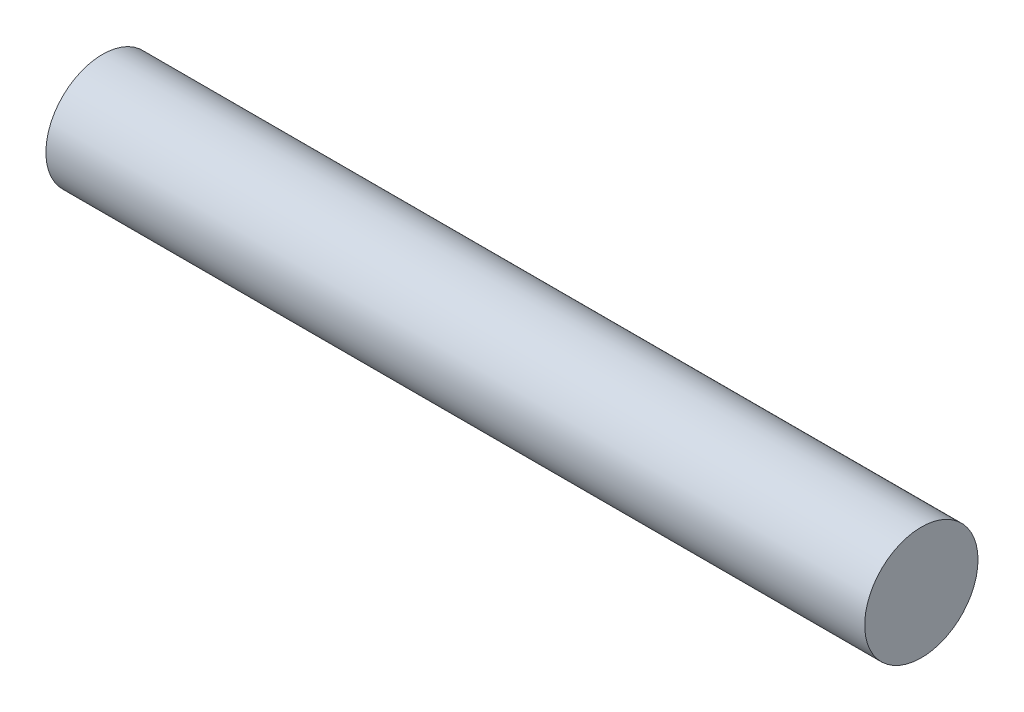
ISO-10303-21;
HEADER;
FILE_DESCRIPTION(('STEP AP214'),'2;1');
FILE_NAME('part.step','',(''),(''),'','','');
FILE_SCHEMA(('AUTOMOTIVE_DESIGN { 1 0 10303 214 1 1 1 1 }'));
ENDSEC;
DATA;
#1=APPLICATION_CONTEXT('core data for automotive mechanical design processes');
#2=APPLICATION_PROTOCOL_DEFINITION('international standard','automotive_design',2000,#1);
#3=PRODUCT_CONTEXT('',#1,'mechanical');
#4=PRODUCT('Part','Part','',(#3));
#5=PRODUCT_RELATED_PRODUCT_CATEGORY('part','',(#4));
#6=PRODUCT_DEFINITION_FORMATION('','',#4);
#7=PRODUCT_DEFINITION_CONTEXT('part definition',#1,'design');
#8=PRODUCT_DEFINITION('design','',#6,#7);
#9=PRODUCT_DEFINITION_SHAPE('','',#8);
#10=(LENGTH_UNIT() NAMED_UNIT(*) SI_UNIT(.MILLI.,.METRE.));
#11=(NAMED_UNIT(*) PLANE_ANGLE_UNIT() SI_UNIT($,.RADIAN.));
#12=(NAMED_UNIT(*) SI_UNIT($,.STERADIAN.) SOLID_ANGLE_UNIT());
#13=UNCERTAINTY_MEASURE_WITH_UNIT(LENGTH_MEASURE(1.E-05),#10,'distance_accuracy_value','');
#14=(GEOMETRIC_REPRESENTATION_CONTEXT(3) GLOBAL_UNCERTAINTY_ASSIGNED_CONTEXT((#13)) GLOBAL_UNIT_ASSIGNED_CONTEXT((#10,
#11,#12)) REPRESENTATION_CONTEXT('',''));
#15=CARTESIAN_POINT('',(0.,0.,0.));
#16=DIRECTION('',(0.,0.,1.));
#17=DIRECTION('',(1.,0.,0.));
#18=AXIS2_PLACEMENT_3D('',#15,#16,#17);
#19=CARTESIAN_POINT('',(4.699,0.,0.));
#20=DIRECTION('',(-1.,0.,0.));
#21=DIRECTION('',(0.,0.,1.));
#22=AXIS2_PLACEMENT_3D('',#19,#20,#21);
#23=CYLINDRICAL_SURFACE('',#22,0.65024);
#24=CARTESIAN_POINT('',(4.699,0.,0.));
#25=DIRECTION('',(1.,0.,0.));
#26=DIRECTION('',(0.,0.,-1.));
#27=AXIS2_PLACEMENT_3D('',#24,#25,#26);
#28=CIRCLE('',#27,0.65024);
#29=CARTESIAN_POINT('',(4.699,0.,-0.65024));
#30=VERTEX_POINT('',#29);
#31=EDGE_CURVE('E10',#30,#30,#28,.T.);
#32=ORIENTED_EDGE('',*,*,#31,.F.);
#33=EDGE_LOOP('',(#32));
#34=FACE_BOUND('',#33,.T.);
#35=CARTESIAN_POINT('',(-4.699,0.,0.));
#36=DIRECTION('',(1.,0.,0.));
#37=DIRECTION('',(0.,0.,-1.));
#38=AXIS2_PLACEMENT_3D('',#35,#36,#37);
#39=CIRCLE('',#38,0.65024);
#40=CARTESIAN_POINT('',(-4.699,0.,-0.65024));
#41=VERTEX_POINT('',#40);
#42=EDGE_CURVE('E36',#41,#41,#39,.T.);
#43=ORIENTED_EDGE('',*,*,#42,.T.);
#44=EDGE_LOOP('',(#43));
#45=FACE_BOUND('',#44,.T.);
#46=ADVANCED_FACE('F33',(#34,#45),#23,.T.);
#47=CARTESIAN_POINT('',(4.699,0.,0.));
#48=DIRECTION('',(1.,0.,0.));
#49=DIRECTION('',(0.,0.,-1.));
#50=AXIS2_PLACEMENT_3D('',#47,#48,#49);
#51=PLANE('',#50);
#52=ORIENTED_EDGE('',*,*,#31,.T.);
#53=EDGE_LOOP('',(#52));
#54=FACE_BOUND('',#53,.T.);
#55=ADVANCED_FACE('F48',(#54),#51,.T.);
#56=CARTESIAN_POINT('',(-4.699,0.,0.));
#57=DIRECTION('',(1.,0.,0.));
#58=DIRECTION('',(0.,0.,-1.));
#59=AXIS2_PLACEMENT_3D('',#56,#57,#58);
#60=PLANE('',#59);
#61=ORIENTED_EDGE('',*,*,#42,.F.);
#62=EDGE_LOOP('',(#61));
#63=FACE_BOUND('',#62,.T.);
#64=ADVANCED_FACE('F46',(#63),#60,.F.);
#65=CLOSED_SHELL('',(#46,#55,#64));
#66=MANIFOLD_SOLID_BREP('B2',#65);
#67=ADVANCED_BREP_SHAPE_REPRESENTATION('',(#18,#66),#14);
#68=SHAPE_DEFINITION_REPRESENTATION(#9,#67);
ENDSEC;
END-ISO-10303-21;
